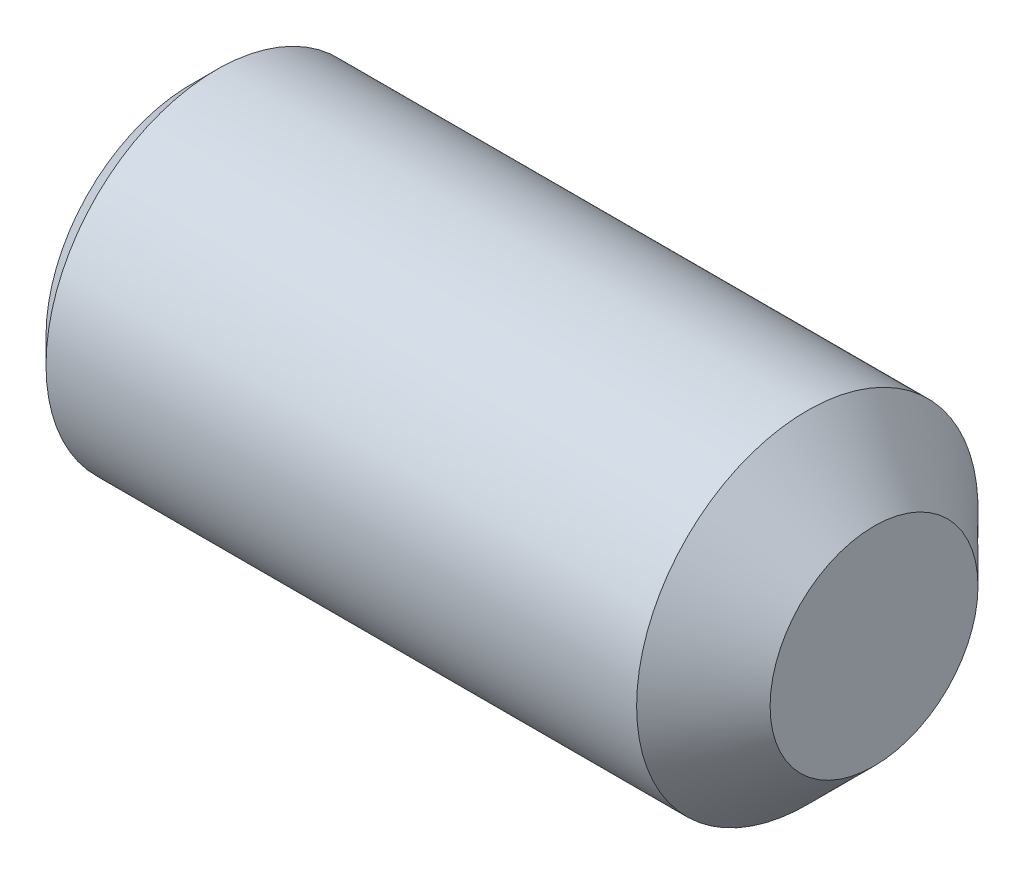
ISO-10303-21;
HEADER;
FILE_DESCRIPTION(('STEP AP214'),'2;1');
FILE_NAME('part.step','',(''),(''),'','','');
FILE_SCHEMA(('AUTOMOTIVE_DESIGN { 1 0 10303 214 1 1 1 1 }'));
ENDSEC;
DATA;
#1=APPLICATION_CONTEXT('core data for automotive mechanical design processes');
#2=APPLICATION_PROTOCOL_DEFINITION('international standard','automotive_design',2000,#1);
#3=PRODUCT_CONTEXT('',#1,'mechanical');
#4=PRODUCT('Part','Part','',(#3));
#5=PRODUCT_RELATED_PRODUCT_CATEGORY('part','',(#4));
#6=PRODUCT_DEFINITION_FORMATION('','',#4);
#7=PRODUCT_DEFINITION_CONTEXT('part definition',#1,'design');
#8=PRODUCT_DEFINITION('design','',#6,#7);
#9=PRODUCT_DEFINITION_SHAPE('','',#8);
#10=(LENGTH_UNIT() NAMED_UNIT(*) SI_UNIT(.MILLI.,.METRE.));
#11=(NAMED_UNIT(*) PLANE_ANGLE_UNIT() SI_UNIT($,.RADIAN.));
#12=(NAMED_UNIT(*) SI_UNIT($,.STERADIAN.) SOLID_ANGLE_UNIT());
#13=UNCERTAINTY_MEASURE_WITH_UNIT(LENGTH_MEASURE(1.E-05),#10,'distance_accuracy_value','');
#14=(GEOMETRIC_REPRESENTATION_CONTEXT(3) GLOBAL_UNCERTAINTY_ASSIGNED_CONTEXT((#13)) GLOBAL_UNIT_ASSIGNED_CONTEXT((#10,
#11,#12)) REPRESENTATION_CONTEXT('',''));
#15=CARTESIAN_POINT('',(0.,0.,0.));
#16=DIRECTION('',(0.,0.,1.));
#17=DIRECTION('',(1.,0.,0.));
#18=AXIS2_PLACEMENT_3D('',#15,#16,#17);
#19=CARTESIAN_POINT('',(0.,0.,0.));
#20=DIRECTION('',(-1.,0.,0.));
#21=DIRECTION('',(0.,0.,1.));
#22=AXIS2_PLACEMENT_3D('',#19,#20,#21);
#23=PLANE('',#22);
#24=CARTESIAN_POINT('',(0.,0.,0.));
#25=DIRECTION('',(-1.,0.,0.));
#26=DIRECTION('',(0.,0.,1.));
#27=AXIS2_PLACEMENT_3D('',#24,#25,#26);
#28=CIRCLE('',#27,10.81024);
#29=CARTESIAN_POINT('',(0.,0.,10.81024));
#30=VERTEX_POINT('',#29);
#31=EDGE_CURVE('E11',#30,#30,#28,.T.);
#32=ORIENTED_EDGE('',*,*,#31,.T.);
#33=EDGE_LOOP('',(#32));
#34=FACE_BOUND('',#33,.T.);
#35=DIRECTION('',(0.,0.,-1.));
#36=VECTOR('',#35,1.);
#37=CARTESIAN_POINT('',(0.,7.1374,4.12077981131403));
#38=LINE('',#37,#36);
#39=CARTESIAN_POINT('',(0.,7.1374,4.12077981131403));
#40=VERTEX_POINT('',#39);
#41=CARTESIAN_POINT('',(0.,7.1374,-4.12077981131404));
#42=VERTEX_POINT('',#41);
#43=EDGE_CURVE('E124',#40,#42,#38,.T.);
#44=ORIENTED_EDGE('',*,*,#43,.F.);
#45=DIRECTION('',(0.,-0.866025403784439,0.5));
#46=VECTOR('',#45,1.);
#47=CARTESIAN_POINT('',(0.,7.1374,4.12077981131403));
#48=LINE('',#47,#46);
#49=CARTESIAN_POINT('',(0.,0.,8.24155962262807));
#50=VERTEX_POINT('',#49);
#51=EDGE_CURVE('E46',#40,#50,#48,.T.);
#52=ORIENTED_EDGE('',*,*,#51,.T.);
#53=DIRECTION('',(0.,0.866025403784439,0.5));
#54=VECTOR('',#53,1.);
#55=CARTESIAN_POINT('',(0.,-7.13739999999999,4.12077981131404));
#56=LINE('',#55,#54);
#57=CARTESIAN_POINT('',(0.,-7.13739999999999,4.12077981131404));
#58=VERTEX_POINT('',#57);
#59=EDGE_CURVE('E115',#58,#50,#56,.T.);
#60=ORIENTED_EDGE('',*,*,#59,.F.);
#61=DIRECTION('',(0.,0.,-1.));
#62=VECTOR('',#61,1.);
#63=CARTESIAN_POINT('',(0.,-7.13739999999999,4.12077981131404));
#64=LINE('',#63,#62);
#65=CARTESIAN_POINT('',(0.,-7.13739999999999,-4.12077981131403));
#66=VERTEX_POINT('',#65);
#67=EDGE_CURVE('E118',#58,#66,#64,.T.);
#68=ORIENTED_EDGE('',*,*,#67,.T.);
#69=DIRECTION('',(0.,0.866025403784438,-0.500000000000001));
#70=VECTOR('',#69,1.);
#71=CARTESIAN_POINT('',(0.,-7.13739999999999,-4.12077981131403));
#72=LINE('',#71,#70);
#73=CARTESIAN_POINT('',(0.,0.,-8.24155962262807));
#74=VERTEX_POINT('',#73);
#75=EDGE_CURVE('E121',#66,#74,#72,.T.);
#76=ORIENTED_EDGE('',*,*,#75,.T.);
#77=DIRECTION('',(0.,-0.866025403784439,-0.5));
#78=VECTOR('',#77,1.);
#79=CARTESIAN_POINT('',(0.,7.1374,-4.12077981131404));
#80=LINE('',#79,#78);
#81=EDGE_CURVE('E104',#42,#74,#80,.T.);
#82=ORIENTED_EDGE('',*,*,#81,.F.);
#83=EDGE_LOOP('',(#44,#52,#60,#68,#76,#82));
#84=FACE_BOUND('',#83,.T.);
#85=ADVANCED_FACE('F32',(#34,#84),#23,.T.);
#86=CARTESIAN_POINT('',(0.,0.,0.));
#87=DIRECTION('',(1.,0.,0.));
#88=DIRECTION('',(0.,0.,-1.));
#89=AXIS2_PLACEMENT_3D('',#86,#87,#88);
#90=CONICAL_SURFACE('',#89,10.81024,0.785398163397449);
#91=CARTESIAN_POINT('',(1.88976,0.,0.));
#92=DIRECTION('',(-1.,0.,0.));
#93=DIRECTION('',(0.,0.,1.));
#94=AXIS2_PLACEMENT_3D('',#91,#92,#93);
#95=CIRCLE('',#94,12.7);
#96=CARTESIAN_POINT('',(1.88976,0.,12.7));
#97=VERTEX_POINT('',#96);
#98=EDGE_CURVE('E39',#97,#97,#95,.T.);
#99=ORIENTED_EDGE('',*,*,#98,.T.);
#100=EDGE_LOOP('',(#99));
#101=FACE_BOUND('',#100,.T.);
#102=ORIENTED_EDGE('',*,*,#31,.F.);
#103=EDGE_LOOP('',(#102));
#104=FACE_BOUND('',#103,.T.);
#105=ADVANCED_FACE('F141',(#101,#104),#90,.T.);
#106=CARTESIAN_POINT('',(-12.7,0.,0.));
#107=DIRECTION('',(-1.,0.,0.));
#108=DIRECTION('',(0.,0.,1.));
#109=AXIS2_PLACEMENT_3D('',#106,#107,#108);
#110=CYLINDRICAL_SURFACE('',#109,12.7);
#111=CARTESIAN_POINT('',(45.8343,0.,0.));
#112=DIRECTION('',(-1.,0.,0.));
#113=DIRECTION('',(0.,0.,1.));
#114=AXIS2_PLACEMENT_3D('',#111,#112,#113);
#115=CIRCLE('',#114,12.7);
#116=CARTESIAN_POINT('',(45.8343,0.,12.7));
#117=VERTEX_POINT('',#116);
#118=EDGE_CURVE('E136',#117,#117,#115,.T.);
#119=ORIENTED_EDGE('',*,*,#118,.T.);
#120=EDGE_LOOP('',(#119));
#121=FACE_BOUND('',#120,.T.);
#122=ORIENTED_EDGE('',*,*,#98,.F.);
#123=EDGE_LOOP('',(#122));
#124=FACE_BOUND('',#123,.T.);
#125=ADVANCED_FACE('F144',(#121,#124),#110,.T.);
#126=CARTESIAN_POINT('',(45.8343,0.,0.));
#127=DIRECTION('',(-1.,0.,0.));
#128=DIRECTION('',(0.,0.,1.));
#129=AXIS2_PLACEMENT_3D('',#126,#127,#128);
#130=CONICAL_SURFACE('',#129,12.7,0.785398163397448);
#131=CARTESIAN_POINT('',(50.8,0.,0.));
#132=DIRECTION('',(-1.,0.,0.));
#133=DIRECTION('',(0.,0.,1.));
#134=AXIS2_PLACEMENT_3D('',#131,#132,#133);
#135=CIRCLE('',#134,7.7343);
#136=CARTESIAN_POINT('',(50.8,0.,7.7343));
#137=VERTEX_POINT('',#136);
#138=EDGE_CURVE('E133',#137,#137,#135,.T.);
#139=ORIENTED_EDGE('',*,*,#138,.T.);
#140=EDGE_LOOP('',(#139));
#141=FACE_BOUND('',#140,.T.);
#142=ORIENTED_EDGE('',*,*,#118,.F.);
#143=EDGE_LOOP('',(#142));
#144=FACE_BOUND('',#143,.T.);
#145=ADVANCED_FACE('F146',(#141,#144),#130,.T.);
#146=CARTESIAN_POINT('',(50.8,7.7343,0.));
#147=DIRECTION('',(1.,0.,0.));
#148=DIRECTION('',(0.,0.,-1.));
#149=AXIS2_PLACEMENT_3D('',#146,#147,#148);
#150=PLANE('',#149);
#151=ORIENTED_EDGE('',*,*,#138,.F.);
#152=EDGE_LOOP('',(#151));
#153=FACE_BOUND('',#152,.T.);
#154=ADVANCED_FACE('F153',(#153),#150,.T.);
#155=CARTESIAN_POINT('',(14.2748,7.1374,4.12077981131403));
#156=DIRECTION('',(0.,-0.5,-0.866025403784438));
#157=DIRECTION('',(0.,0.866025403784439,-0.5));
#158=AXIS2_PLACEMENT_3D('',#155,#156,#157);
#159=PLANE('',#158);
#160=ORIENTED_EDGE('',*,*,#51,.F.);
#161=DIRECTION('',(-1.,0.,0.));
#162=VECTOR('',#161,1.);
#163=CARTESIAN_POINT('',(14.2748,7.1374,4.12077981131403));
#164=LINE('',#163,#162);
#165=CARTESIAN_POINT('',(14.2748,7.1374,4.12077981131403));
#166=VERTEX_POINT('',#165);
#167=EDGE_CURVE('E51',#166,#40,#164,.T.);
#168=ORIENTED_EDGE('',*,*,#167,.F.);
#169=DIRECTION('',(0.,-0.866025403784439,0.5));
#170=VECTOR('',#169,1.);
#171=CARTESIAN_POINT('',(14.2748,7.1374,4.12077981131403));
#172=LINE('',#171,#170);
#173=CARTESIAN_POINT('',(14.2748,0.,8.24155962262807));
#174=VERTEX_POINT('',#173);
#175=EDGE_CURVE('E78',#166,#174,#172,.T.);
#176=ORIENTED_EDGE('',*,*,#175,.T.);
#177=DIRECTION('',(-1.,0.,0.));
#178=VECTOR('',#177,1.);
#179=CARTESIAN_POINT('',(14.2748,0.,8.24155962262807));
#180=LINE('',#179,#178);
#181=EDGE_CURVE('E131',#174,#50,#180,.T.);
#182=ORIENTED_EDGE('',*,*,#181,.T.);
#183=EDGE_LOOP('',(#160,#168,#176,#182));
#184=FACE_BOUND('',#183,.T.);
#185=ADVANCED_FACE('F184',(#184),#159,.T.);
#186=CARTESIAN_POINT('',(14.2748,-7.13739999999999,4.12077981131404));
#187=DIRECTION('',(0.,-0.5,0.866025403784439));
#188=DIRECTION('',(0.,-0.866025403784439,-0.5));
#189=AXIS2_PLACEMENT_3D('',#186,#187,#188);
#190=PLANE('',#189);
#191=ORIENTED_EDGE('',*,*,#59,.T.);
#192=ORIENTED_EDGE('',*,*,#181,.F.);
#193=DIRECTION('',(0.,0.866025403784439,0.5));
#194=VECTOR('',#193,1.);
#195=CARTESIAN_POINT('',(14.2748,-7.13739999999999,4.12077981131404));
#196=LINE('',#195,#194);
#197=CARTESIAN_POINT('',(14.2748,-7.13739999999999,4.12077981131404));
#198=VERTEX_POINT('',#197);
#199=EDGE_CURVE('E262',#198,#174,#196,.T.);
#200=ORIENTED_EDGE('',*,*,#199,.F.);
#201=DIRECTION('',(-1.,0.,0.));
#202=VECTOR('',#201,1.);
#203=CARTESIAN_POINT('',(14.2748,-7.13739999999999,4.12077981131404));
#204=LINE('',#203,#202);
#205=EDGE_CURVE('E129',#198,#58,#204,.T.);
#206=ORIENTED_EDGE('',*,*,#205,.T.);
#207=EDGE_LOOP('',(#191,#192,#200,#206));
#208=FACE_BOUND('',#207,.T.);
#209=ADVANCED_FACE('F180',(#208),#190,.F.);
#210=CARTESIAN_POINT('',(14.2748,-7.13739999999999,4.12077981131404));
#211=DIRECTION('',(0.,1.,0.));
#212=DIRECTION('',(0.,0.,1.));
#213=AXIS2_PLACEMENT_3D('',#210,#211,#212);
#214=PLANE('',#213);
#215=ORIENTED_EDGE('',*,*,#67,.F.);
#216=ORIENTED_EDGE('',*,*,#205,.F.);
#217=DIRECTION('',(0.,0.,-1.));
#218=VECTOR('',#217,1.);
#219=CARTESIAN_POINT('',(14.2748,-7.13739999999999,4.12077981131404));
#220=LINE('',#219,#218);
#221=CARTESIAN_POINT('',(14.2748,-7.13739999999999,-4.12077981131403));
#222=VERTEX_POINT('',#221);
#223=EDGE_CURVE('E99',#198,#222,#220,.T.);
#224=ORIENTED_EDGE('',*,*,#223,.T.);
#225=DIRECTION('',(-1.,0.,0.));
#226=VECTOR('',#225,1.);
#227=CARTESIAN_POINT('',(14.2748,-7.13739999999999,-4.12077981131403));
#228=LINE('',#227,#226);
#229=EDGE_CURVE('E94',#222,#66,#228,.T.);
#230=ORIENTED_EDGE('',*,*,#229,.T.);
#231=EDGE_LOOP('',(#215,#216,#224,#230));
#232=FACE_BOUND('',#231,.T.);
#233=ADVANCED_FACE('F177',(#232),#214,.T.);
#234=CARTESIAN_POINT('',(14.2748,-7.13739999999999,-4.12077981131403));
#235=DIRECTION('',(0.,0.500000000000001,0.866025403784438));
#236=DIRECTION('',(0.,-0.866025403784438,0.500000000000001));
#237=AXIS2_PLACEMENT_3D('',#234,#235,#236);
#238=PLANE('',#237);
#239=ORIENTED_EDGE('',*,*,#75,.F.);
#240=ORIENTED_EDGE('',*,*,#229,.F.);
#241=DIRECTION('',(0.,0.866025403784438,-0.500000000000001));
#242=VECTOR('',#241,1.);
#243=CARTESIAN_POINT('',(14.2748,-7.13739999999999,-4.12077981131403));
#244=LINE('',#243,#242);
#245=CARTESIAN_POINT('',(14.2748,0.,-8.24155962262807));
#246=VERTEX_POINT('',#245);
#247=EDGE_CURVE('E89',#222,#246,#244,.T.);
#248=ORIENTED_EDGE('',*,*,#247,.T.);
#249=DIRECTION('',(-1.,0.,0.));
#250=VECTOR('',#249,1.);
#251=CARTESIAN_POINT('',(14.2748,0.,-8.24155962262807));
#252=LINE('',#251,#250);
#253=EDGE_CURVE('E93',#246,#74,#252,.T.);
#254=ORIENTED_EDGE('',*,*,#253,.T.);
#255=EDGE_LOOP('',(#239,#240,#248,#254));
#256=FACE_BOUND('',#255,.T.);
#257=ADVANCED_FACE('F92',(#256),#238,.T.);
#258=CARTESIAN_POINT('',(14.2748,7.1374,-4.12077981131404));
#259=DIRECTION('',(0.,0.5,-0.866025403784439));
#260=DIRECTION('',(0.,0.866025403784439,0.5));
#261=AXIS2_PLACEMENT_3D('',#258,#259,#260);
#262=PLANE('',#261);
#263=ORIENTED_EDGE('',*,*,#81,.T.);
#264=ORIENTED_EDGE('',*,*,#253,.F.);
#265=DIRECTION('',(0.,-0.866025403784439,-0.5));
#266=VECTOR('',#265,1.);
#267=CARTESIAN_POINT('',(14.2748,7.1374,-4.12077981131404));
#268=LINE('',#267,#266);
#269=CARTESIAN_POINT('',(14.2748,7.1374,-4.12077981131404));
#270=VERTEX_POINT('',#269);
#271=EDGE_CURVE('E98',#270,#246,#268,.T.);
#272=ORIENTED_EDGE('',*,*,#271,.F.);
#273=DIRECTION('',(-1.,0.,0.));
#274=VECTOR('',#273,1.);
#275=CARTESIAN_POINT('',(14.2748,7.1374,-4.12077981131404));
#276=LINE('',#275,#274);
#277=EDGE_CURVE('E74',#270,#42,#276,.T.);
#278=ORIENTED_EDGE('',*,*,#277,.T.);
#279=EDGE_LOOP('',(#263,#264,#272,#278));
#280=FACE_BOUND('',#279,.T.);
#281=ADVANCED_FACE('F101',(#280),#262,.F.);
#282=CARTESIAN_POINT('',(14.2748,7.1374,4.12077981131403));
#283=DIRECTION('',(0.,1.,0.));
#284=DIRECTION('',(0.,0.,1.));
#285=AXIS2_PLACEMENT_3D('',#282,#283,#284);
#286=PLANE('',#285);
#287=ORIENTED_EDGE('',*,*,#43,.T.);
#288=ORIENTED_EDGE('',*,*,#277,.F.);
#289=DIRECTION('',(0.,0.,-1.));
#290=VECTOR('',#289,1.);
#291=CARTESIAN_POINT('',(14.2748,7.1374,4.12077981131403));
#292=LINE('',#291,#290);
#293=EDGE_CURVE('E109',#166,#270,#292,.T.);
#294=ORIENTED_EDGE('',*,*,#293,.F.);
#295=ORIENTED_EDGE('',*,*,#167,.T.);
#296=EDGE_LOOP('',(#287,#288,#294,#295));
#297=FACE_BOUND('',#296,.T.);
#298=ADVANCED_FACE('F165',(#297),#286,.F.);
#299=CARTESIAN_POINT('',(14.2748,14.2748,0.));
#300=DIRECTION('',(1.,0.,0.));
#301=DIRECTION('',(0.,0.,-1.));
#302=AXIS2_PLACEMENT_3D('',#299,#300,#301);
#303=PLANE('',#302);
#304=ORIENTED_EDGE('',*,*,#175,.F.);
#305=ORIENTED_EDGE('',*,*,#293,.T.);
#306=ORIENTED_EDGE('',*,*,#271,.T.);
#307=ORIENTED_EDGE('',*,*,#247,.F.);
#308=ORIENTED_EDGE('',*,*,#223,.F.);
#309=ORIENTED_EDGE('',*,*,#199,.T.);
#310=EDGE_LOOP('',(#304,#305,#306,#307,#308,#309));
#311=FACE_BOUND('',#310,.T.);
#312=ADVANCED_FACE('F107',(#311),#303,.F.);
#313=CLOSED_SHELL('',(#85,#105,#125,#145,#154,#185,#209,#233,#257,#281,#298,#312));
#314=MANIFOLD_SOLID_BREP('B2',#313);
#315=ADVANCED_BREP_SHAPE_REPRESENTATION('',(#18,#314),#14);
#316=SHAPE_DEFINITION_REPRESENTATION(#9,#315);
ENDSEC;
END-ISO-10303-21;
